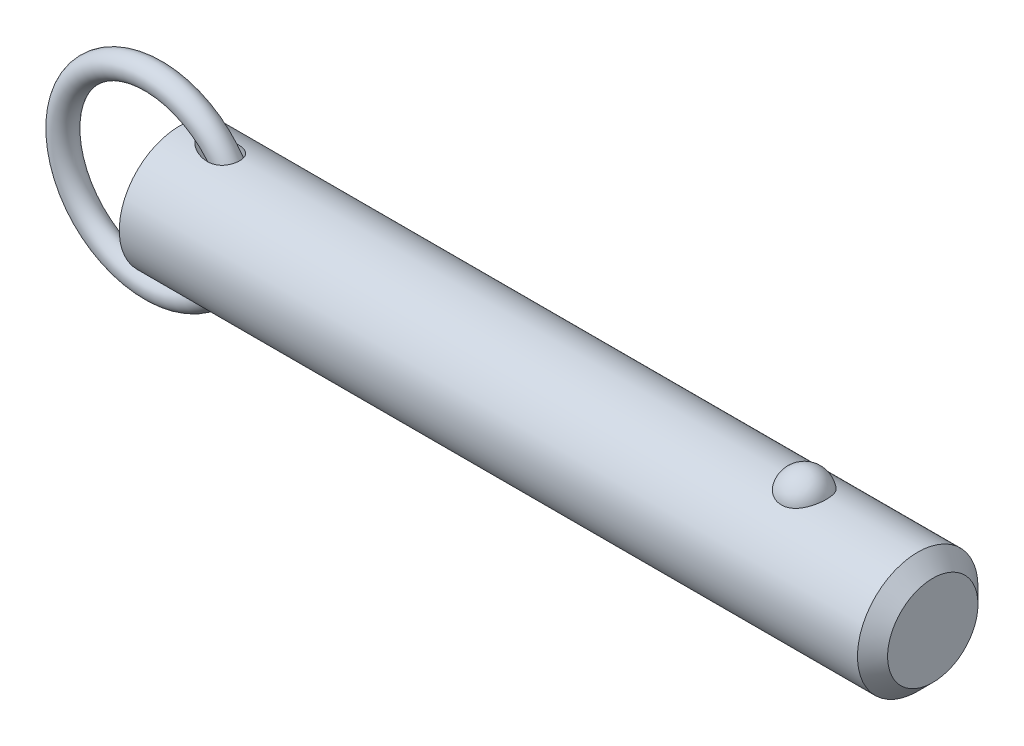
ISO-10303-21;
HEADER;
FILE_DESCRIPTION(('STEP AP214'),'2;1');
FILE_NAME('part.step','',(''),(''),'','','');
FILE_SCHEMA(('AUTOMOTIVE_DESIGN { 1 0 10303 214 1 1 1 1 }'));
ENDSEC;
DATA;
#1=APPLICATION_CONTEXT('core data for automotive mechanical design processes');
#2=APPLICATION_PROTOCOL_DEFINITION('international standard','automotive_design',2000,#1);
#3=PRODUCT_CONTEXT('',#1,'mechanical');
#4=PRODUCT('Part','Part','',(#3));
#5=PRODUCT_RELATED_PRODUCT_CATEGORY('part','',(#4));
#6=PRODUCT_DEFINITION_FORMATION('','',#4);
#7=PRODUCT_DEFINITION_CONTEXT('part definition',#1,'design');
#8=PRODUCT_DEFINITION('design','',#6,#7);
#9=PRODUCT_DEFINITION_SHAPE('','',#8);
#10=(LENGTH_UNIT() NAMED_UNIT(*) SI_UNIT(.MILLI.,.METRE.));
#11=(NAMED_UNIT(*) PLANE_ANGLE_UNIT() SI_UNIT($,.RADIAN.));
#12=(NAMED_UNIT(*) SI_UNIT($,.STERADIAN.) SOLID_ANGLE_UNIT());
#13=UNCERTAINTY_MEASURE_WITH_UNIT(LENGTH_MEASURE(1.E-05),#10,'distance_accuracy_value','');
#14=(GEOMETRIC_REPRESENTATION_CONTEXT(3) GLOBAL_UNCERTAINTY_ASSIGNED_CONTEXT((#13)) GLOBAL_UNIT_ASSIGNED_CONTEXT((#10,
#11,#12)) REPRESENTATION_CONTEXT('',''));
#15=CARTESIAN_POINT('',(0.,0.,0.));
#16=DIRECTION('',(0.,0.,1.));
#17=DIRECTION('',(1.,0.,0.));
#18=AXIS2_PLACEMENT_3D('',#15,#16,#17);
#19=CARTESIAN_POINT('',(-5.53898640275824,0.,0.));
#20=DIRECTION('',(0.,0.,1.));
#21=DIRECTION('',(1.,0.,0.));
#22=AXIS2_PLACEMENT_3D('',#19,#20,#21);
#23=TOROIDAL_SURFACE('',#22,19.05,2.54);
#24=CARTESIAN_POINT('',(16.0510135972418,0.,0.));
#25=VERTEX_POINT('',#24);
#26=VERTEX_LOOP('',#25);
#27=FACE_BOUND('',#26,.T.);
#28=ADVANCED_FACE('P0_F12',(#27),#23,.T.);
#29=CLOSED_SHELL('',(#28));
#30=MANIFOLD_SOLID_BREP('P0_B1',#29);
#31=CARTESIAN_POINT('',(0.,0.,0.));
#32=DIRECTION('',(1.,0.,0.));
#33=DIRECTION('',(0.,0.,-1.));
#34=AXIS2_PLACEMENT_3D('',#31,#32,#33);
#35=CYLINDRICAL_SURFACE('',#34,12.7);
#36=CARTESIAN_POINT('',(155.575,0.,0.));
#37=DIRECTION('',(1.,0.,0.));
#38=DIRECTION('',(0.,0.,-1.));
#39=AXIS2_PLACEMENT_3D('',#36,#37,#38);
#40=CIRCLE('',#39,12.7);
#41=CARTESIAN_POINT('',(155.575,0.,-12.7));
#42=VERTEX_POINT('',#41);
#43=EDGE_CURVE('P1_E89',#42,#42,#40,.T.);
#44=ORIENTED_EDGE('',*,*,#43,.F.);
#45=EDGE_LOOP('',(#44));
#46=FACE_BOUND('',#45,.T.);
#47=CARTESIAN_POINT('',(0.,0.,0.));
#48=DIRECTION('',(1.,0.,0.));
#49=DIRECTION('',(0.,0.,-1.));
#50=AXIS2_PLACEMENT_3D('',#47,#48,#49);
#51=CIRCLE('',#50,12.7);
#52=CARTESIAN_POINT('',(0.,0.,-12.7));
#53=VERTEX_POINT('',#52);
#54=EDGE_CURVE('P1_E52',#53,#53,#51,.T.);
#55=ORIENTED_EDGE('',*,*,#54,.T.);
#56=EDGE_LOOP('',(#55));
#57=FACE_BOUND('',#56,.T.);
#58=CARTESIAN_POINT('',(131.660042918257,11.7500437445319,4.81938502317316));
#59=CARTESIAN_POINT('',(131.535088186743,11.7500430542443,4.81938571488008));
#60=CARTESIAN_POINT('',(131.410144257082,11.7520975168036,4.81438658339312));
#61=CARTESIAN_POINT('',(131.161142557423,11.760253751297,4.79442904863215));
#62=CARTESIAN_POINT('',(131.037085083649,11.7663568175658,4.77946746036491));
#63=CARTESIAN_POINT('',(130.790901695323,11.7824262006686,4.73971414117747));
#64=CARTESIAN_POINT('',(130.668774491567,11.7923898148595,4.71492928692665));
#65=CARTESIAN_POINT('',(130.427187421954,11.8158938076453,4.65571340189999));
#66=CARTESIAN_POINT('',(130.30772859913,11.8294355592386,4.62127866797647));
#67=CARTESIAN_POINT('',(130.072557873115,11.8596812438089,4.54309502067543));
#68=CARTESIAN_POINT('',(129.956839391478,11.8763792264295,4.49936361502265));
#69=CARTESIAN_POINT('',(129.729653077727,11.9124878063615,4.40287235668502));
#70=CARTESIAN_POINT('',(129.618186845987,11.9318994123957,4.35010914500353));
#71=CARTESIAN_POINT('',(129.291278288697,11.9934256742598,4.1788131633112));
#72=CARTESIAN_POINT('',(129.083127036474,12.038858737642,4.04720756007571));
#73=CARTESIAN_POINT('',(128.685850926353,12.1352173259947,3.74856446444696));
#74=CARTESIAN_POINT('',(128.497443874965,12.1862630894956,3.5806182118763));
#75=CARTESIAN_POINT('',(128.150521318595,12.2875163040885,3.2160075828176));
#76=CARTESIAN_POINT('',(127.992011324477,12.3377235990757,3.01933792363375));
#77=CARTESIAN_POINT('',(127.70168878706,12.4344923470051,2.59291655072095));
#78=CARTESIAN_POINT('',(127.571376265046,12.4807925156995,2.36208286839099));
#79=CARTESIAN_POINT('',(127.349407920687,12.5623454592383,1.88070399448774));
#80=CARTESIAN_POINT('',(127.257755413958,12.5975972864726,1.63015711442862));
#81=CARTESIAN_POINT('',(127.114046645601,12.6538414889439,1.11298869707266));
#82=CARTESIAN_POINT('',(127.062499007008,12.6746503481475,0.846205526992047));
#83=CARTESIAN_POINT('',(127.001977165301,12.699153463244,0.307085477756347));
#84=CARTESIAN_POINT('',(126.993001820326,12.7028481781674,0.0347487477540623));
#85=CARTESIAN_POINT('',(127.017731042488,12.6927785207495,-0.506073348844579));
#86=CARTESIAN_POINT('',(127.051189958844,12.6791146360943,-0.774571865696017));
#87=CARTESIAN_POINT('',(127.159687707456,12.635882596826,-1.30170246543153));
#88=CARTESIAN_POINT('',(127.23472729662,12.606314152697,-1.56033436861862));
#89=CARTESIAN_POINT('',(127.425000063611,12.5342328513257,-2.06083899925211));
#90=CARTESIAN_POINT('',(127.540287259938,12.4917026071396,-2.30268867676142));
#91=CARTESIAN_POINT('',(127.808704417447,12.3981123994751,-2.76259600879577));
#92=CARTESIAN_POINT('',(127.961837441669,12.3470517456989,-2.98065173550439));
#93=CARTESIAN_POINT('',(128.303507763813,12.2416045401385,-3.38786328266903));
#94=CARTESIAN_POINT('',(128.492201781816,12.1872040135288,-3.57688418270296));
#95=CARTESIAN_POINT('',(128.900239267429,12.0814086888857,-3.91941073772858));
#96=CARTESIAN_POINT('',(129.119580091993,12.0300136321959,-4.07291945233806));
#97=CARTESIAN_POINT('',(129.578375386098,11.9373542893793,-4.33691289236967));
#98=CARTESIAN_POINT('',(129.817304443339,11.8958982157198,-4.44824125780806));
#99=CARTESIAN_POINT('',(130.31243761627,11.8268116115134,-4.62881985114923));
#100=CARTESIAN_POINT('',(130.568635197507,11.7991758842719,-4.69808589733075));
#101=CARTESIAN_POINT('',(131.077164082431,11.7622209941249,-4.78983181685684));
#102=CARTESIAN_POINT('',(131.329041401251,11.7520502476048,-4.8144902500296));
#103=CARTESIAN_POINT('',(131.833573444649,11.7485796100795,-4.82295735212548));
#104=CARTESIAN_POINT('',(132.086228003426,11.7552763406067,-4.80677420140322));
#105=CARTESIAN_POINT('',(132.576834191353,11.7842584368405,-4.73525430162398));
#106=CARTESIAN_POINT('',(132.814998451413,11.8060486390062,-4.68116061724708));
#107=CARTESIAN_POINT('',(133.278489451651,11.8622750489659,-4.53678133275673));
#108=CARTESIAN_POINT('',(133.503815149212,11.8967122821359,-4.44649279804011));
#109=CARTESIAN_POINT('',(133.940801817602,11.9754603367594,-4.22987613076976));
#110=CARTESIAN_POINT('',(134.152057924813,12.0199699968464,-4.10280539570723));
#111=CARTESIAN_POINT('',(134.550601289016,12.1138028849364,-3.81685409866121));
#112=CARTESIAN_POINT('',(134.737883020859,12.163127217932,-3.65796622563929));
#113=CARTESIAN_POINT('',(135.093350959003,12.2642343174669,-3.30364864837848));
#114=CARTESIAN_POINT('',(135.260111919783,12.316016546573,-3.10678783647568));
#115=CARTESIAN_POINT('',(135.559579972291,12.4142566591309,-2.68748409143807));
#116=CARTESIAN_POINT('',(135.692280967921,12.4607135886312,-2.46503658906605));
#117=CARTESIAN_POINT('',(135.924691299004,12.5450236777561,-1.99289519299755));
#118=CARTESIAN_POINT('',(136.023215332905,12.5825557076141,-1.74255918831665));
#119=CARTESIAN_POINT('',(136.179227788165,12.6431720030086,-1.22773734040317));
#120=CARTESIAN_POINT('',(136.236715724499,12.6662560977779,-0.963251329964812));
#121=CARTESIAN_POINT('',(136.309544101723,12.6956486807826,-0.427355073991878));
#122=CARTESIAN_POINT('',(136.324837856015,12.7019385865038,-0.155937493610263));
#123=CARTESIAN_POINT('',(136.312779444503,12.6970201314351,0.385928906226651));
#124=CARTESIAN_POINT('',(136.28542805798,12.6858120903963,0.656377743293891));
#125=CARTESIAN_POINT('',(136.213060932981,12.6568455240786,1.05454017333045));
#126=CARTESIAN_POINT('',(136.183796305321,12.6451962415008,1.18577850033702));
#127=CARTESIAN_POINT('',(136.115022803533,12.6181819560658,1.44513808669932));
#128=CARTESIAN_POINT('',(136.075517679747,12.6028183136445,1.57326046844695));
#129=CARTESIAN_POINT('',(135.986439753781,12.5687547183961,1.82554978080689));
#130=CARTESIAN_POINT('',(135.936862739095,12.5500533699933,1.94971503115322));
#131=CARTESIAN_POINT('',(135.82792115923,12.5098093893,2.19314370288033));
#132=CARTESIAN_POINT('',(135.768560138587,12.4882677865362,2.31240887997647));
#133=CARTESIAN_POINT('',(135.63997128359,12.4427679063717,2.5459303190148));
#134=CARTESIAN_POINT('',(135.570688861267,12.4187964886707,2.66015396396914));
#135=CARTESIAN_POINT('',(135.422903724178,12.3691892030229,2.882026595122));
#136=CARTESIAN_POINT('',(135.344404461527,12.3435539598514,2.98967802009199));
#137=CARTESIAN_POINT('',(135.178550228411,12.2912955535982,3.1977438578));
#138=CARTESIAN_POINT('',(135.091191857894,12.2646720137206,3.29815546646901));
#139=CARTESIAN_POINT('',(134.908161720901,12.2111945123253,3.49095035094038));
#140=CARTESIAN_POINT('',(134.812493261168,12.1843406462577,3.58333679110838));
#141=CARTESIAN_POINT('',(134.613627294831,12.1312249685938,3.75922876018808));
#142=CARTESIAN_POINT('',(134.510450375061,12.104961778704,3.84275713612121));
#143=CARTESIAN_POINT('',(134.29701336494,12.0537284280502,4.00056406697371));
#144=CARTESIAN_POINT('',(134.186756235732,12.028757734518,4.07484645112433));
#145=CARTESIAN_POINT('',(133.959755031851,11.9808306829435,4.21367959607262));
#146=CARTESIAN_POINT('',(133.843006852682,11.9578756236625,4.27822410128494));
#147=CARTESIAN_POINT('',(133.60394258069,11.9147184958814,4.39698483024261));
#148=CARTESIAN_POINT('',(133.481628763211,11.894515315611,4.45120522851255));
#149=CARTESIAN_POINT('',(133.222952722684,11.8561129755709,4.55255353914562));
#150=CARTESIAN_POINT('',(133.086223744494,11.8381764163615,4.59884858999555));
#151=CARTESIAN_POINT('',(132.808608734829,11.8069093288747,4.67853897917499));
#152=CARTESIAN_POINT('',(132.667724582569,11.7935767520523,4.71194005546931));
#153=CARTESIAN_POINT('',(132.38309446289,11.7720277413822,4.7655218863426));
#154=CARTESIAN_POINT('',(132.239348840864,11.7638106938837,4.7857042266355));
#155=CARTESIAN_POINT('',(131.950411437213,11.7528195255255,4.81263433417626));
#156=CARTESIAN_POINT('',(131.805219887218,11.7500445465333,4.81938421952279));
#157=CARTESIAN_POINT('',(131.660042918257,11.7500437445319,4.81938502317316));
#158=B_SPLINE_CURVE_WITH_KNOTS('',3,(#58,#59,#60,#61,#62,#63,#64,#65,#66,#67,#68,#69,#70,#71,
#72,#73,#74,#75,#76,#77,#78,#79,#80,#81,#82,#83,#84,#85,#86,#87,#88,#89,#90,#91,#92,#93,#94,#95,
#96,#97,#98,#99,#100,#101,#102,#103,#104,#105,#106,#107,#108,#109,#110,#111,#112,#113,#114,#115,
#116,#117,#118,#119,#120,#121,#122,#123,#124,#125,#126,#127,#128,#129,#130,#131,#132,#133,#134,
#135,#136,#137,#138,#139,#140,#141,#142,#143,#144,#145,#146,#147,#148,#149,#150,#151,#152,#153,
#154,#155,#156,#157),.UNSPECIFIED.,.T.,.F.,(4,2,2,2,2,2,2,2,2,2,2,2,2,2,2,2,2,2,2,2,2,2,2,2,2,2,
2,2,2,2,2,2,2,2,2,2,2,2,2,2,2,2,2,2,2,2,2,2,2,4),(0.,0.374729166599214,0.749578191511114,
1.12416526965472,1.49889629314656,1.87292776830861,2.24709865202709,2.99481328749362,
3.76399449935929,4.53331735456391,5.33683915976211,6.14042986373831,6.95405296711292,
7.76765424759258,8.57656703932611,9.38549455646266,10.1955119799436,11.0055949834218,
11.8193353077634,12.6330054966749,13.4294141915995,14.2255231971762,14.9815786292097,
15.7374826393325,16.4696948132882,17.2019663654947,17.950197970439,18.6986017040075,
19.484470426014,20.2704797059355,21.0815215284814,21.8925729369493,22.7045213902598,
23.5164550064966,23.9209608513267,24.3253187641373,24.7298461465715,25.1342272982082,
25.5409255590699,25.9474719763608,26.3541750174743,26.760716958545,27.1661834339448,
27.5714814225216,27.9770386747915,28.382431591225,28.8181206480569,29.2536155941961,
29.6890582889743,30.1244323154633),.UNSPECIFIED.);
#159=CARTESIAN_POINT('',(131.660042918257,11.7500437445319,4.81938502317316));
#160=VERTEX_POINT('',#159);
#161=EDGE_CURVE('P1_E80',#160,#160,#158,.T.);
#162=ORIENTED_EDGE('',*,*,#161,.T.);
#163=EDGE_LOOP('',(#162));
#164=FACE_BOUND('',#163,.T.);
#165=CARTESIAN_POINT('',(-5.53898640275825,0.,0.));
#166=DIRECTION('',(0.796400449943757,-0.604769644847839,0.));
#167=DIRECTION('',(0.604769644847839,0.796400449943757,0.));
#168=AXIS2_PLACEMENT_3D('',#165,#166,#167);
#169=ELLIPSE('',#168,15.9467514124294,12.7);
#170=CARTESIAN_POINT('',(4.0948214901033,12.6864319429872,0.586893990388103));
#171=VERTEX_POINT('',#170);
#172=CARTESIAN_POINT('',(4.0948214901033,12.6864319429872,-0.586893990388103));
#173=VERTEX_POINT('',#172);
#174=EDGE_CURVE('P1_E47',#171,#173,#169,.F.);
#175=ORIENTED_EDGE('',*,*,#174,.T.);
#176=CARTESIAN_POINT('',(4.06153170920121,12.6905758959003,-0.48916605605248));
#177=CARTESIAN_POINT('',(4.08111374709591,12.6881366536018,-0.552489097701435));
#178=CARTESIAN_POINT('',(4.10417851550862,12.6852663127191,-0.614604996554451));
#179=CARTESIAN_POINT('',(4.15628434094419,12.6787965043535,-0.736067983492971));
#180=CARTESIAN_POINT('',(4.18531032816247,12.6751988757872,-0.795421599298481));
#181=CARTESIAN_POINT('',(4.27911159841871,12.6636052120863,-0.967590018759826));
#182=CARTESIAN_POINT('',(4.35123408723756,12.654730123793,-1.07635920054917));
#183=CARTESIAN_POINT('',(4.49106800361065,12.6376715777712,-1.25922957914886));
#184=CARTESIAN_POINT('',(4.55601066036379,12.6297947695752,-1.33556751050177));
#185=CARTESIAN_POINT('',(4.69223626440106,12.6134116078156,-1.48232741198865));
#186=CARTESIAN_POINT('',(4.76352147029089,12.6049050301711,-1.55274725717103));
#187=CARTESIAN_POINT('',(4.91163946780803,12.587417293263,-1.68868704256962));
#188=CARTESIAN_POINT('',(4.98851399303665,12.5784327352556,-1.75416062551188));
#189=CARTESIAN_POINT('',(5.14630057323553,12.560235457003,-1.88003275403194));
#190=CARTESIAN_POINT('',(5.22721398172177,12.5510226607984,-1.94042957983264));
#191=CARTESIAN_POINT('',(5.45368877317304,12.5256514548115,-2.09966332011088));
#192=CARTESIAN_POINT('',(5.60261616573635,12.5094182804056,-2.19371988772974));
#193=CARTESIAN_POINT('',(5.90795545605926,12.4774211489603,-2.36893890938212));
#194=CARTESIAN_POINT('',(6.06437232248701,12.4616575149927,-2.45009264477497));
#195=CARTESIAN_POINT('',(6.38306132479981,12.431227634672,-2.60008249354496));
#196=CARTESIAN_POINT('',(6.54533237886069,12.4165611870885,-2.66892086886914));
#197=CARTESIAN_POINT('',(6.87462618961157,12.3889351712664,-2.79435199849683));
#198=CARTESIAN_POINT('',(7.0416477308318,12.3759751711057,-2.85094785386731));
#199=CARTESIAN_POINT('',(7.38726647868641,12.3518460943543,-2.95377962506));
#200=CARTESIAN_POINT('',(7.56604577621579,12.3407843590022,-2.9994320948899));
#201=CARTESIAN_POINT('',(7.92698692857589,12.3219309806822,-3.07596683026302));
#202=CARTESIAN_POINT('',(8.10914972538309,12.314140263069,-3.1068449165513));
#203=CARTESIAN_POINT('',(8.47511457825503,12.3025918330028,-3.15226850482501));
#204=CARTESIAN_POINT('',(8.6589097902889,12.2988216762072,-3.16686440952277));
#205=CARTESIAN_POINT('',(9.02696087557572,12.2959421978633,-3.17802250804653));
#206=CARTESIAN_POINT('',(9.21121628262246,12.2968292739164,-3.17459864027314));
#207=CARTESIAN_POINT('',(9.61636263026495,12.3045198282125,-3.14471110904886));
#208=CARTESIAN_POINT('',(9.83695552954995,12.3125080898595,-3.1136323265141));
#209=CARTESIAN_POINT('',(10.1619126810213,12.3303028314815,-3.04206574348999));
#210=CARTESIAN_POINT('',(10.2692747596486,12.3372061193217,-3.01403983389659));
#211=CARTESIAN_POINT('',(10.4811758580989,12.3528538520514,-2.94925947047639));
#212=CARTESIAN_POINT('',(10.5857162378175,12.361597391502,-2.91250930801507));
#213=CARTESIAN_POINT('',(10.7921321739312,12.3808585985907,-2.82951748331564));
#214=CARTESIAN_POINT('',(10.8939665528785,12.3913944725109,-2.78317723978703));
#215=CARTESIAN_POINT('',(11.0926118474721,12.4138762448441,-2.68112002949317));
#216=CARTESIAN_POINT('',(11.1894254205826,12.4258213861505,-2.62540809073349));
#217=CARTESIAN_POINT('',(11.3768740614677,12.4507225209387,-2.5046565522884));
#218=CARTESIAN_POINT('',(11.46751150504,12.4636781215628,-2.43962056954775));
#219=CARTESIAN_POINT('',(11.6414572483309,12.4901070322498,-2.30048560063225));
#220=CARTESIAN_POINT('',(11.7247669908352,12.5035802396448,-2.2263884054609));
#221=CARTESIAN_POINT('',(11.8713131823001,12.5285000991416,-2.08117367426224));
#222=CARTESIAN_POINT('',(11.9357009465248,12.5399538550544,-2.0112159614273));
#223=CARTESIAN_POINT('',(12.0576805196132,12.5624496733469,-1.86555293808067));
#224=CARTESIAN_POINT('',(12.1152732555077,12.5734917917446,-1.78984841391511));
#225=CARTESIAN_POINT('',(12.2230738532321,12.5947858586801,-1.63327883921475));
#226=CARTESIAN_POINT('',(12.2732844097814,12.6050380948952,-1.55241568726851));
#227=CARTESIAN_POINT('',(12.3658430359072,12.6243983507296,-1.38621267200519));
#228=CARTESIAN_POINT('',(12.4081916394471,12.6335064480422,-1.30087311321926));
#229=CARTESIAN_POINT('',(12.5150098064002,12.6569076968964,-1.05702619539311));
#230=CARTESIAN_POINT('',(12.5703399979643,12.6695746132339,-0.894232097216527));
#231=CARTESIAN_POINT('',(12.6526225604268,12.6886816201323,-0.561391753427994));
#232=CARTESIAN_POINT('',(12.6795825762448,12.6951233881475,-0.391347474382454));
#233=CARTESIAN_POINT('',(12.7041016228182,12.7009766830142,-0.0537636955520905));
#234=CARTESIAN_POINT('',(12.7024538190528,12.7005778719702,0.113714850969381));
#235=CARTESIAN_POINT('',(12.6717240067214,12.6932548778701,0.445979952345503));
#236=CARTESIAN_POINT('',(12.6426435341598,12.6863310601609,0.610766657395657));
#237=CARTESIAN_POINT('',(12.5579769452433,12.6667465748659,0.932429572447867));
#238=CARTESIAN_POINT('',(12.5024793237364,12.6541050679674,1.08933027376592));
#239=CARTESIAN_POINT('',(12.3665691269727,12.6244558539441,1.39146752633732));
#240=CARTESIAN_POINT('',(12.2861577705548,12.6074483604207,1.53670464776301));
#241=CARTESIAN_POINT('',(12.1018203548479,12.5706804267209,1.81319588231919));
#242=CARTESIAN_POINT('',(11.9976588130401,12.5508932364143,1.94428915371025));
#243=CARTESIAN_POINT('',(11.7695265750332,12.5107540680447,2.18776051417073));
#244=CARTESIAN_POINT('',(11.6455540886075,12.4904020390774,2.30013691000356));
#245=CARTESIAN_POINT('',(11.3759347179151,12.4502278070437,2.50870972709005));
#246=CARTESIAN_POINT('',(11.2295880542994,12.4304654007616,2.60400962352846));
#247=CARTESIAN_POINT('',(10.9239803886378,12.3941696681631,2.7716292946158));
#248=CARTESIAN_POINT('',(10.7647152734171,12.3776373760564,2.84394171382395));
#249=CARTESIAN_POINT('',(10.4192039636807,12.3473062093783,2.9730352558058));
#250=CARTESIAN_POINT('',(10.231933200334,12.3340204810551,3.02717164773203));
#251=CARTESIAN_POINT('',(9.85152982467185,12.3134301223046,3.10986173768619));
#252=CARTESIAN_POINT('',(9.65839336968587,12.3061295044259,3.13839827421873));
#253=CARTESIAN_POINT('',(9.31022514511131,12.2982822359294,3.16897517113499));
#254=CARTESIAN_POINT('',(9.15555718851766,12.2966525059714,3.1752689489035));
#255=CARTESIAN_POINT('',(8.84618945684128,12.2967963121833,3.17471335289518));
#256=CARTESIAN_POINT('',(8.69148970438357,12.2985715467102,3.16785742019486));
#257=CARTESIAN_POINT('',(8.3828047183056,12.3051648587,3.14214692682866));
#258=CARTESIAN_POINT('',(8.22882218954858,12.3099904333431,3.12326280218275));
#259=CARTESIAN_POINT('',(7.92276070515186,12.3222644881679,3.07448013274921));
#260=CARTESIAN_POINT('',(7.77068148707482,12.3297126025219,3.04458312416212));
#261=CARTESIAN_POINT('',(7.46452663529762,12.3470493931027,2.97350781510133));
#262=CARTESIAN_POINT('',(7.31052714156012,12.3570043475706,2.93201910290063));
#263=CARTESIAN_POINT('',(7.00579083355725,12.3787609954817,2.83876185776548));
#264=CARTESIAN_POINT('',(6.85505451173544,12.3905629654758,2.78699178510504));
#265=CARTESIAN_POINT('',(6.55781208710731,12.415528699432,2.67357744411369));
#266=CARTESIAN_POINT('',(6.41129783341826,12.4286895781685,2.61195394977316));
#267=CARTESIAN_POINT('',(6.12302950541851,12.4559398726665,2.47874512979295));
#268=CARTESIAN_POINT('',(5.98127390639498,12.4700289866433,2.40716303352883));
#269=CARTESIAN_POINT('',(5.67073126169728,12.5020754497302,2.23550426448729));
#270=CARTESIAN_POINT('',(5.50343839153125,12.5201625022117,2.13268685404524));
#271=CARTESIAN_POINT('',(5.26147616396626,12.5471537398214,1.96522579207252));
#272=CARTESIAN_POINT('',(5.18224299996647,12.5561365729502,1.90713440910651));
#273=CARTESIAN_POINT('',(5.02746475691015,12.573912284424,1.78618989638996));
#274=CARTESIAN_POINT('',(4.95191912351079,12.5827051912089,1.72333748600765));
#275=CARTESIAN_POINT('',(4.8178716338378,12.598469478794,1.60360864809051));
#276=CARTESIAN_POINT('',(4.75865966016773,12.6054958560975,1.54753994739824));
#277=CARTESIAN_POINT('',(4.64406285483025,12.6191906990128,1.43158546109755));
#278=CARTESIAN_POINT('',(4.5886792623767,12.6258590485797,1.37169845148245));
#279=CARTESIAN_POINT('',(4.43014912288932,12.6450546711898,1.18656670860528));
#280=CARTESIAN_POINT('',(4.3337272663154,12.6568788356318,1.05507993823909));
#281=CARTESIAN_POINT('',(4.21252055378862,12.6718304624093,0.84805289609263));
#282=CARTESIAN_POINT('',(4.17660155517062,12.6762773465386,0.779100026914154));
#283=CARTESIAN_POINT('',(4.11264979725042,12.6842122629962,0.637080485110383));
#284=CARTESIAN_POINT('',(4.08466792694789,12.6876941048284,0.563990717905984));
#285=CARTESIAN_POINT('',(4.06153170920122,12.6905758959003,0.489166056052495));
#286=B_SPLINE_CURVE_WITH_KNOTS('',3,(#176,#177,#178,#179,#180,#181,#182,#183,#184,#185,#186,
#187,#188,#189,#190,#191,#192,#193,#194,#195,#196,#197,#198,#199,#200,#201,#202,#203,#204,#205,
#206,#207,#208,#209,#210,#211,#212,#213,#214,#215,#216,#217,#218,#219,#220,#221,#222,#223,#224,
#225,#226,#227,#228,#229,#230,#231,#232,#233,#234,#235,#236,#237,#238,#239,#240,#241,#242,#243,
#244,#245,#246,#247,#248,#249,#250,#251,#252,#253,#254,#255,#256,#257,#258,#259,#260,#261,#262,
#263,#264,#265,#266,#267,#268,#269,#270,#271,#272,#273,#274,#275,#276,#277,#278,#279,#280,#281,
#282,#283,#284,#285),.UNSPECIFIED.,.F.,.F.,(4,2,2,2,2,2,2,2,2,2,2,2,2,2,2,2,2,2,2,2,2,2,2,2,2,2,
2,2,2,2,2,2,2,2,2,2,2,2,2,2,2,2,2,2,2,2,2,2,2,2,2,2,2,2,4),(0.,0.198708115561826,
0.39691995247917,0.787580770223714,1.08882492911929,1.39017679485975,1.69407136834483,
1.99806847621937,2.52793143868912,3.05815092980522,3.58827293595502,4.11826050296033,
4.67218806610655,5.22627222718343,5.77863637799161,6.3305733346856,6.99657211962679,
7.32977411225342,7.66281254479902,7.99946156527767,8.33593054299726,8.67226935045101,
9.00854178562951,9.29544181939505,9.58230266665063,9.86905853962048,10.1557949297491,
10.6702338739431,11.1845341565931,11.6845985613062,12.1846349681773,12.6830079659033,
13.1813565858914,13.68487951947,14.1884479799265,14.713533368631,15.2387866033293,
15.8228373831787,16.407279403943,16.8710810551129,17.3351141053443,17.8002921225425,
18.2654052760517,18.7444169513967,19.2235004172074,19.701586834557,20.1795185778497,
20.7699825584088,21.0658110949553,21.3615950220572,21.606957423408,21.8523988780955,
22.3397467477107,22.5729183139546,22.8075527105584),.UNSPECIFIED.);
#287=EDGE_CURVE('P1_E51',#173,#171,#286,.T.);
#288=ORIENTED_EDGE('',*,*,#287,.T.);
#289=EDGE_LOOP('',(#175,#288));
#290=FACE_BOUND('',#289,.T.);
#291=CARTESIAN_POINT('',(-5.53898640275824,0.,0.));
#292=DIRECTION('',(-0.796400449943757,-0.604769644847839,0.));
#293=DIRECTION('',(0.604769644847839,-0.796400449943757,0.));
#294=AXIS2_PLACEMENT_3D('',#291,#292,#293);
#295=ELLIPSE('',#294,15.9467514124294,12.7);
#296=CARTESIAN_POINT('',(4.09482149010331,-12.6864319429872,0.586893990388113));
#297=VERTEX_POINT('',#296);
#298=CARTESIAN_POINT('',(4.09482149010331,-12.6864319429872,-0.586893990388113));
#299=VERTEX_POINT('',#298);
#300=EDGE_CURVE('P1_E28',#297,#299,#295,.F.);
#301=ORIENTED_EDGE('',*,*,#300,.F.);
#302=CARTESIAN_POINT('',(4.06153170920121,-12.6905758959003,0.489166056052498));
#303=CARTESIAN_POINT('',(4.08111374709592,-12.6881366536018,0.552489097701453));
#304=CARTESIAN_POINT('',(4.10417851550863,-12.6852663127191,0.614604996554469));
#305=CARTESIAN_POINT('',(4.1562843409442,-12.6787965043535,0.736067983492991));
#306=CARTESIAN_POINT('',(4.18531032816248,-12.6751988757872,0.795421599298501));
#307=CARTESIAN_POINT('',(4.27911159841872,-12.6636052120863,0.96759001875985));
#308=CARTESIAN_POINT('',(4.35123408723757,-12.654730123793,1.07635920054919));
#309=CARTESIAN_POINT('',(4.49106800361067,-12.6376715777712,1.25922957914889));
#310=CARTESIAN_POINT('',(4.55601066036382,-12.6297947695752,1.33556751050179));
#311=CARTESIAN_POINT('',(4.69223626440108,-12.6134116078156,1.48232741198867));
#312=CARTESIAN_POINT('',(4.76352147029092,-12.6049050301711,1.55274725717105));
#313=CARTESIAN_POINT('',(4.91163946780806,-12.587417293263,1.68868704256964));
#314=CARTESIAN_POINT('',(4.98851399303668,-12.5784327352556,1.7541606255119));
#315=CARTESIAN_POINT('',(5.14630057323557,-12.560235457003,1.88003275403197));
#316=CARTESIAN_POINT('',(5.2272139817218,-12.5510226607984,1.94042957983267));
#317=CARTESIAN_POINT('',(5.45368877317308,-12.5256514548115,2.09966332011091));
#318=CARTESIAN_POINT('',(5.6026161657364,-12.5094182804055,2.19371988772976));
#319=CARTESIAN_POINT('',(5.90795545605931,-12.4774211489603,2.36893890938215));
#320=CARTESIAN_POINT('',(6.06437232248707,-12.4616575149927,2.450092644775));
#321=CARTESIAN_POINT('',(6.38306132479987,-12.431227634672,2.60008249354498));
#322=CARTESIAN_POINT('',(6.54533237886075,-12.4165611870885,2.66892086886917));
#323=CARTESIAN_POINT('',(6.87462618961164,-12.3889351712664,2.79435199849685));
#324=CARTESIAN_POINT('',(7.04164773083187,-12.3759751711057,2.85094785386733));
#325=CARTESIAN_POINT('',(7.38726647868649,-12.3518460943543,2.95377962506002));
#326=CARTESIAN_POINT('',(7.56604577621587,-12.3407843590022,2.99943209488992));
#327=CARTESIAN_POINT('',(7.92698692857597,-12.3219309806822,3.07596683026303));
#328=CARTESIAN_POINT('',(8.10914972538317,-12.314140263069,3.10684491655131));
#329=CARTESIAN_POINT('',(8.47511457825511,-12.3025918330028,3.15226850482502));
#330=CARTESIAN_POINT('',(8.65890979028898,-12.2988216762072,3.16686440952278));
#331=CARTESIAN_POINT('',(9.02696087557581,-12.2959421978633,3.17802250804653));
#332=CARTESIAN_POINT('',(9.21121628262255,-12.2968292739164,3.17459864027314));
#333=CARTESIAN_POINT('',(9.61636263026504,-12.3045198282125,3.14471110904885));
#334=CARTESIAN_POINT('',(9.83695552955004,-12.3125080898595,3.11363232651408));
#335=CARTESIAN_POINT('',(10.1619126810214,-12.3303028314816,3.04206574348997));
#336=CARTESIAN_POINT('',(10.2692747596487,-12.3372061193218,3.01403983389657));
#337=CARTESIAN_POINT('',(10.481175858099,-12.3528538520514,2.94925947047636));
#338=CARTESIAN_POINT('',(10.5857162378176,-12.361597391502,2.91250930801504));
#339=CARTESIAN_POINT('',(10.7921321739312,-12.3808585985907,2.82951748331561));
#340=CARTESIAN_POINT('',(10.8939665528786,-12.3913944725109,2.783177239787));
#341=CARTESIAN_POINT('',(11.0926118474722,-12.4138762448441,2.68112002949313));
#342=CARTESIAN_POINT('',(11.1894254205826,-12.4258213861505,2.62540809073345));
#343=CARTESIAN_POINT('',(11.3768740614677,-12.4507225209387,2.50465655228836));
#344=CARTESIAN_POINT('',(11.4675115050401,-12.4636781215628,2.43962056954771));
#345=CARTESIAN_POINT('',(11.641457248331,-12.4901070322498,2.30048560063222));
#346=CARTESIAN_POINT('',(11.7247669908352,-12.5035802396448,2.22638840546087));
#347=CARTESIAN_POINT('',(11.8713131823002,-12.5285000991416,2.0811736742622));
#348=CARTESIAN_POINT('',(11.9357009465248,-12.5399538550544,2.01121596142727));
#349=CARTESIAN_POINT('',(12.0576805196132,-12.5624496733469,1.86555293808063));
#350=CARTESIAN_POINT('',(12.1152732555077,-12.5734917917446,1.78984841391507));
#351=CARTESIAN_POINT('',(12.2230738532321,-12.5947858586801,1.63327883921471));
#352=CARTESIAN_POINT('',(12.2732844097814,-12.6050380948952,1.55241568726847));
#353=CARTESIAN_POINT('',(12.3658430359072,-12.6243983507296,1.38621267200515));
#354=CARTESIAN_POINT('',(12.4081916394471,-12.6335064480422,1.30087311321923));
#355=CARTESIAN_POINT('',(12.5150098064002,-12.6569076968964,1.05702619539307));
#356=CARTESIAN_POINT('',(12.5703399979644,-12.6695746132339,0.894232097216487));
#357=CARTESIAN_POINT('',(12.6526225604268,-12.6886816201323,0.561391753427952));
#358=CARTESIAN_POINT('',(12.6795825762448,-12.6951233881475,0.391347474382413));
#359=CARTESIAN_POINT('',(12.7041016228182,-12.7009766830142,0.0537636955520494));
#360=CARTESIAN_POINT('',(12.7024538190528,-12.7005778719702,-0.113714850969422));
#361=CARTESIAN_POINT('',(12.6717240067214,-12.6932548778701,-0.445979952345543));
#362=CARTESIAN_POINT('',(12.6426435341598,-12.6863310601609,-0.610766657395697));
#363=CARTESIAN_POINT('',(12.5579769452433,-12.6667465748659,-0.932429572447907));
#364=CARTESIAN_POINT('',(12.5024793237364,-12.6541050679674,-1.08933027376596));
#365=CARTESIAN_POINT('',(12.3665691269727,-12.6244558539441,-1.39146752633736));
#366=CARTESIAN_POINT('',(12.2861577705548,-12.6074483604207,-1.53670464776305));
#367=CARTESIAN_POINT('',(12.1018203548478,-12.5706804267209,-1.81319588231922));
#368=CARTESIAN_POINT('',(11.99765881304,-12.5508932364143,-1.94428915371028));
#369=CARTESIAN_POINT('',(11.7695265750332,-12.5107540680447,-2.18776051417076));
#370=CARTESIAN_POINT('',(11.6455540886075,-12.4904020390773,-2.30013691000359));
#371=CARTESIAN_POINT('',(11.375934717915,-12.4502278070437,-2.50870972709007));
#372=CARTESIAN_POINT('',(11.2295880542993,-12.4304654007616,-2.60400962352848));
#373=CARTESIAN_POINT('',(10.9239803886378,-12.3941696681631,-2.77162929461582));
#374=CARTESIAN_POINT('',(10.764715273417,-12.3776373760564,-2.84394171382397));
#375=CARTESIAN_POINT('',(10.4192039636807,-12.3473062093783,-2.97303525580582));
#376=CARTESIAN_POINT('',(10.2319332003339,-12.3340204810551,-3.02717164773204));
#377=CARTESIAN_POINT('',(9.85152982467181,-12.3134301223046,-3.1098617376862));
#378=CARTESIAN_POINT('',(9.65839336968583,-12.3061295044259,-3.13839827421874));
#379=CARTESIAN_POINT('',(9.31022514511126,-12.2982822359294,-3.16897517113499));
#380=CARTESIAN_POINT('',(9.15555718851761,-12.2966525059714,-3.1752689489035));
#381=CARTESIAN_POINT('',(8.84618945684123,-12.2967963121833,-3.17471335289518));
#382=CARTESIAN_POINT('',(8.69148970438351,-12.2985715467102,-3.16785742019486));
#383=CARTESIAN_POINT('',(8.38280471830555,-12.3051648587,-3.14214692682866));
#384=CARTESIAN_POINT('',(8.22882218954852,-12.3099904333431,-3.12326280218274));
#385=CARTESIAN_POINT('',(7.9227607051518,-12.3222644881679,-3.0744801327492));
#386=CARTESIAN_POINT('',(7.77068148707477,-12.329712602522,-3.04458312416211));
#387=CARTESIAN_POINT('',(7.46452663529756,-12.3470493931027,-2.97350781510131));
#388=CARTESIAN_POINT('',(7.31052714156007,-12.3570043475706,-2.93201910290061));
#389=CARTESIAN_POINT('',(7.00579083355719,-12.3787609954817,-2.83876185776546));
#390=CARTESIAN_POINT('',(6.85505451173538,-12.3905629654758,-2.78699178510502));
#391=CARTESIAN_POINT('',(6.55781208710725,-12.415528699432,-2.67357744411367));
#392=CARTESIAN_POINT('',(6.41129783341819,-12.4286895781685,-2.61195394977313));
#393=CARTESIAN_POINT('',(6.12302950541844,-12.4559398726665,-2.47874512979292));
#394=CARTESIAN_POINT('',(5.98127390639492,-12.4700289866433,-2.40716303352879));
#395=CARTESIAN_POINT('',(5.67073126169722,-12.5020754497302,-2.23550426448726));
#396=CARTESIAN_POINT('',(5.50343839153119,-12.5201625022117,-2.13268685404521));
#397=CARTESIAN_POINT('',(5.26147616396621,-12.5471537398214,-1.96522579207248));
#398=CARTESIAN_POINT('',(5.18224299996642,-12.5561365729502,-1.90713440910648));
#399=CARTESIAN_POINT('',(5.02746475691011,-12.573912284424,-1.78618989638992));
#400=CARTESIAN_POINT('',(4.95191912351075,-12.5827051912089,-1.72333748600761));
#401=CARTESIAN_POINT('',(4.81787163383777,-12.598469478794,-1.60360864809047));
#402=CARTESIAN_POINT('',(4.75865966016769,-12.6054958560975,-1.5475399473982));
#403=CARTESIAN_POINT('',(4.64406285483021,-12.6191906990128,-1.43158546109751));
#404=CARTESIAN_POINT('',(4.58867926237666,-12.6258590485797,-1.37169845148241));
#405=CARTESIAN_POINT('',(4.4301491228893,-12.6450546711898,-1.18656670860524));
#406=CARTESIAN_POINT('',(4.33372726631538,-12.6568788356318,-1.05507993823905));
#407=CARTESIAN_POINT('',(4.21252055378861,-12.6718304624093,-0.848052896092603));
#408=CARTESIAN_POINT('',(4.1766015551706,-12.6762773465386,-0.779100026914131));
#409=CARTESIAN_POINT('',(4.1126497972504,-12.6842122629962,-0.637080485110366));
#410=CARTESIAN_POINT('',(4.08466792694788,-12.6876941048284,-0.563990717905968));
#411=CARTESIAN_POINT('',(4.06153170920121,-12.6905758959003,-0.489166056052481));
#412=B_SPLINE_CURVE_WITH_KNOTS('',3,(#302,#303,#304,#305,#306,#307,#308,#309,#310,#311,#312,
#313,#314,#315,#316,#317,#318,#319,#320,#321,#322,#323,#324,#325,#326,#327,#328,#329,#330,#331,
#332,#333,#334,#335,#336,#337,#338,#339,#340,#341,#342,#343,#344,#345,#346,#347,#348,#349,#350,
#351,#352,#353,#354,#355,#356,#357,#358,#359,#360,#361,#362,#363,#364,#365,#366,#367,#368,#369,
#370,#371,#372,#373,#374,#375,#376,#377,#378,#379,#380,#381,#382,#383,#384,#385,#386,#387,#388,
#389,#390,#391,#392,#393,#394,#395,#396,#397,#398,#399,#400,#401,#402,#403,#404,#405,#406,#407,
#408,#409,#410,#411),.UNSPECIFIED.,.F.,.F.,(4,2,2,2,2,2,2,2,2,2,2,2,2,2,2,2,2,2,2,2,2,2,2,2,2,2,
2,2,2,2,2,2,2,2,2,2,2,2,2,2,2,2,2,2,2,2,2,2,2,2,2,2,2,2,4),(0.,0.198708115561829,
0.396919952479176,0.787580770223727,1.08882492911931,1.39017679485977,1.69407136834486,
1.9980684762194,2.52793143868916,3.05815092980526,3.58827293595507,4.11826050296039,
4.67218806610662,5.2262722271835,5.77863637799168,6.33057333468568,6.99657211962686,
7.32977411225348,7.66281254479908,7.99946156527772,8.33593054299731,8.67226935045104,
9.00854178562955,9.29544181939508,9.58230266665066,9.8690585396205,10.1557949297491,
10.6702338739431,11.1845341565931,11.6845985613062,12.1846349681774,12.6830079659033,
13.1813565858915,13.68487951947,14.1884479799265,14.713533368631,15.2387866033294,
15.8228373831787,16.407279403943,16.871081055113,17.3351141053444,17.8002921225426,
18.2654052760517,18.7444169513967,19.2235004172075,19.701586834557,20.1795185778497,
20.7699825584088,21.0658110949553,21.3615950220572,21.606957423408,21.8523988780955,
22.3397467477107,22.5729183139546,22.8075527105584),.UNSPECIFIED.);
#413=EDGE_CURVE('P1_E10',#297,#299,#412,.T.);
#414=ORIENTED_EDGE('',*,*,#413,.T.);
#415=EDGE_LOOP('',(#301,#414));
#416=FACE_BOUND('',#415,.T.);
#417=ADVANCED_FACE('P1_F15',(#46,#57,#164,#290,#416),#35,.T.);
#418=CARTESIAN_POINT('',(0.,0.,0.));
#419=DIRECTION('',(-1.,0.,0.));
#420=DIRECTION('',(0.,0.,1.));
#421=AXIS2_PLACEMENT_3D('',#418,#419,#420);
#422=PLANE('',#421);
#423=ORIENTED_EDGE('',*,*,#54,.F.);
#424=EDGE_LOOP('',(#423));
#425=FACE_BOUND('',#424,.T.);
#426=ADVANCED_FACE('P1_F17',(#425),#422,.T.);
#427=CARTESIAN_POINT('',(158.75,0.,0.));
#428=DIRECTION('',(-1.,0.,0.));
#429=DIRECTION('',(0.,0.,1.));
#430=AXIS2_PLACEMENT_3D('',#427,#428,#429);
#431=CONICAL_SURFACE('',#430,9.52500000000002,0.785398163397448);
#432=ORIENTED_EDGE('',*,*,#43,.T.);
#433=EDGE_LOOP('',(#432));
#434=FACE_BOUND('',#433,.T.);
#435=CARTESIAN_POINT('',(158.75,0.,0.));
#436=DIRECTION('',(1.,0.,0.));
#437=DIRECTION('',(0.,0.,-1.));
#438=AXIS2_PLACEMENT_3D('',#435,#436,#437);
#439=CIRCLE('',#438,9.52500000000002);
#440=CARTESIAN_POINT('',(158.75,0.,-9.52500000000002));
#441=VERTEX_POINT('',#440);
#442=EDGE_CURVE('P1_E86',#441,#441,#439,.T.);
#443=ORIENTED_EDGE('',*,*,#442,.F.);
#444=EDGE_LOOP('',(#443));
#445=FACE_BOUND('',#444,.T.);
#446=ADVANCED_FACE('P1_F105',(#434,#445),#431,.T.);
#447=CARTESIAN_POINT('',(158.75,9.52500000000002,0.));
#448=DIRECTION('',(1.,0.,0.));
#449=DIRECTION('',(0.,0.,-1.));
#450=AXIS2_PLACEMENT_3D('',#447,#448,#449);
#451=PLANE('',#450);
#452=ORIENTED_EDGE('',*,*,#442,.T.);
#453=EDGE_LOOP('',(#452));
#454=FACE_BOUND('',#453,.T.);
#455=ADVANCED_FACE('P1_F78',(#454),#451,.T.);
#456=CARTESIAN_POINT('',(131.660042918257,11.43,0.));
#457=DIRECTION('',(-1.,0.,0.));
#458=DIRECTION('',(0.,-1.,0.));
#459=AXIS2_PLACEMENT_3D('',#456,#457,#458);
#460=SPHERICAL_SURFACE('',#459,4.82999999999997);
#461=ORIENTED_EDGE('',*,*,#161,.F.);
#462=EDGE_LOOP('',(#461));
#463=FACE_BOUND('',#462,.T.);
#464=ADVANCED_FACE('P1_F71',(#463),#460,.T.);
#465=CARTESIAN_POINT('',(-5.53898640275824,0.,0.));
#466=DIRECTION('',(0.,0.,1.));
#467=DIRECTION('',(1.,0.,0.));
#468=AXIS2_PLACEMENT_3D('',#465,#466,#467);
#469=TOROIDAL_SURFACE('',#468,19.05,3.175);
#470=CARTESIAN_POINT('',(5.9818753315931,-15.1714285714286,0.));
#471=DIRECTION('',(-0.796400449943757,-0.604769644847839,0.));
#472=DIRECTION('',(0.604769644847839,-0.796400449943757,0.));
#473=AXIS2_PLACEMENT_3D('',#470,#471,#472);
#474=CIRCLE('',#473,3.175);
#475=EDGE_CURVE('P1_E34',#297,#299,#474,.T.);
#476=ORIENTED_EDGE('',*,*,#475,.T.);
#477=ORIENTED_EDGE('',*,*,#413,.F.);
#478=EDGE_LOOP('',(#476,#477));
#479=FACE_BOUND('',#478,.T.);
#480=CARTESIAN_POINT('',(5.98187533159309,15.1714285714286,0.));
#481=DIRECTION('',(0.796400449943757,-0.604769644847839,0.));
#482=DIRECTION('',(0.604769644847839,0.796400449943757,0.));
#483=AXIS2_PLACEMENT_3D('',#480,#481,#482);
#484=CIRCLE('',#483,3.175);
#485=EDGE_CURVE('P1_E41',#171,#173,#484,.T.);
#486=ORIENTED_EDGE('',*,*,#485,.F.);
#487=ORIENTED_EDGE('',*,*,#287,.F.);
#488=EDGE_LOOP('',(#486,#487));
#489=FACE_BOUND('',#488,.T.);
#490=ADVANCED_FACE('P1_F55',(#479,#489),#469,.F.);
#491=CARTESIAN_POINT('',(5.9818753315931,-15.1714285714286,0.));
#492=DIRECTION('',(-0.796400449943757,-0.604769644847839,0.));
#493=DIRECTION('',(0.604769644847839,-0.796400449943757,0.));
#494=AXIS2_PLACEMENT_3D('',#491,#492,#493);
#495=PLANE('',#494);
#496=ORIENTED_EDGE('',*,*,#300,.T.);
#497=ORIENTED_EDGE('',*,*,#475,.F.);
#498=EDGE_LOOP('',(#496,#497));
#499=FACE_BOUND('',#498,.T.);
#500=ADVANCED_FACE('P1_F70',(#499),#495,.F.);
#501=CARTESIAN_POINT('',(5.98187533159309,15.1714285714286,0.));
#502=DIRECTION('',(0.796400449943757,-0.604769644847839,0.));
#503=DIRECTION('',(0.604769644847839,0.796400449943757,0.));
#504=AXIS2_PLACEMENT_3D('',#501,#502,#503);
#505=PLANE('',#504);
#506=ORIENTED_EDGE('',*,*,#485,.T.);
#507=ORIENTED_EDGE('',*,*,#174,.F.);
#508=EDGE_LOOP('',(#506,#507));
#509=FACE_BOUND('',#508,.T.);
#510=ADVANCED_FACE('P1_F48',(#509),#505,.T.);
#511=CLOSED_SHELL('',(#417,#426,#446,#455,#464,#490,#500,#510));
#512=MANIFOLD_SOLID_BREP('P1_B1',#511);
#513=ADVANCED_BREP_SHAPE_REPRESENTATION('',(#18,#30,#512),#14);
#514=SHAPE_DEFINITION_REPRESENTATION(#9,#513);
ENDSEC;
END-ISO-10303-21;
